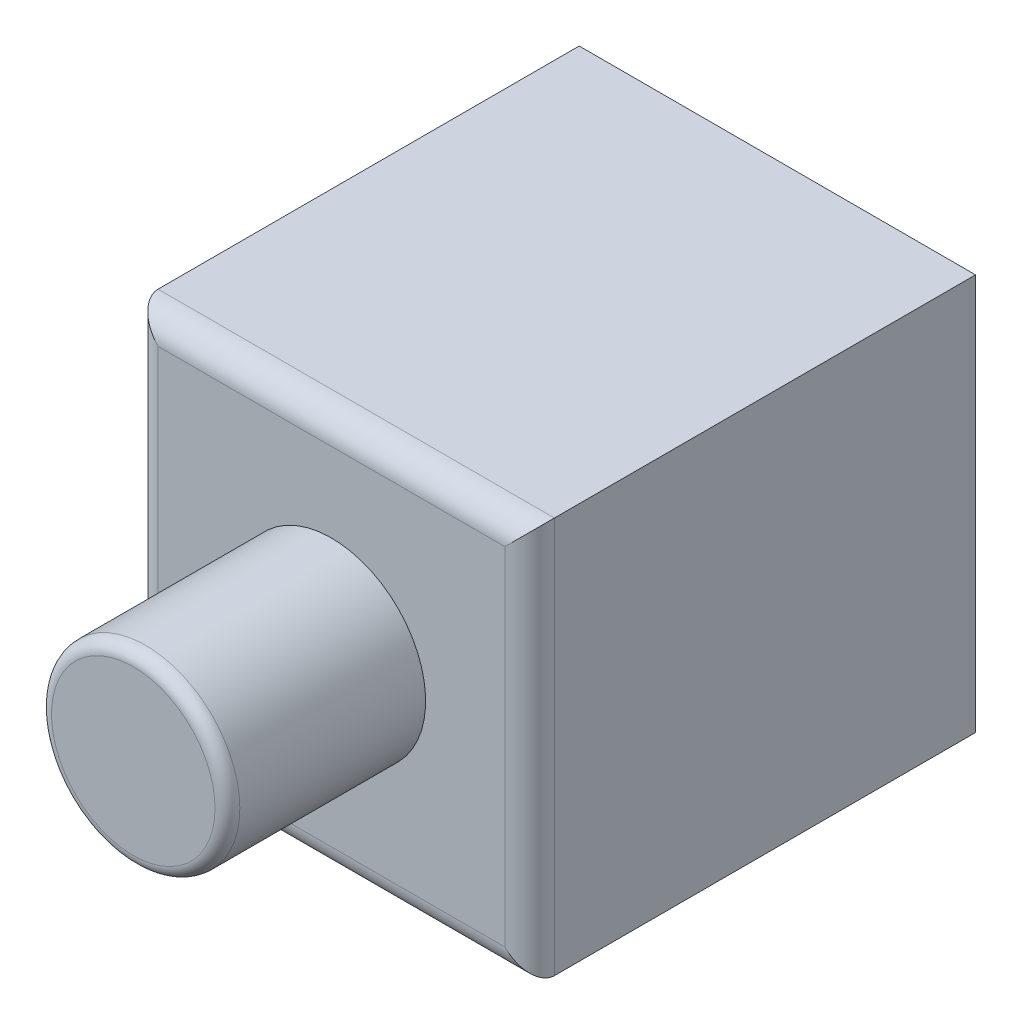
ISO-10303-21;
HEADER;
FILE_DESCRIPTION(('STEP AP214'),'2;1');
FILE_NAME('part.step','',(''),(''),'','','');
FILE_SCHEMA(('AUTOMOTIVE_DESIGN { 1 0 10303 214 1 1 1 1 }'));
ENDSEC;
DATA;
#1=APPLICATION_CONTEXT('core data for automotive mechanical design processes');
#2=APPLICATION_PROTOCOL_DEFINITION('international standard','automotive_design',2000,#1);
#3=PRODUCT_CONTEXT('',#1,'mechanical');
#4=PRODUCT('Part','Part','',(#3));
#5=PRODUCT_RELATED_PRODUCT_CATEGORY('part','',(#4));
#6=PRODUCT_DEFINITION_FORMATION('','',#4);
#7=PRODUCT_DEFINITION_CONTEXT('part definition',#1,'design');
#8=PRODUCT_DEFINITION('design','',#6,#7);
#9=PRODUCT_DEFINITION_SHAPE('','',#8);
#10=(LENGTH_UNIT() NAMED_UNIT(*) SI_UNIT(.MILLI.,.METRE.));
#11=(NAMED_UNIT(*) PLANE_ANGLE_UNIT() SI_UNIT($,.RADIAN.));
#12=(NAMED_UNIT(*) SI_UNIT($,.STERADIAN.) SOLID_ANGLE_UNIT());
#13=UNCERTAINTY_MEASURE_WITH_UNIT(LENGTH_MEASURE(1.E-05),#10,'distance_accuracy_value','');
#14=(GEOMETRIC_REPRESENTATION_CONTEXT(3) GLOBAL_UNCERTAINTY_ASSIGNED_CONTEXT((#13)) GLOBAL_UNIT_ASSIGNED_CONTEXT((#10,
#11,#12)) REPRESENTATION_CONTEXT('',''));
#15=CARTESIAN_POINT('',(0.,0.,0.));
#16=DIRECTION('',(0.,0.,1.));
#17=DIRECTION('',(1.,0.,0.));
#18=AXIS2_PLACEMENT_3D('',#15,#16,#17);
#19=CARTESIAN_POINT('',(-4.00000000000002,4.,9.00000000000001));
#20=DIRECTION('',(0.,0.,1.));
#21=DIRECTION('',(1.,0.,0.));
#22=AXIS2_PLACEMENT_3D('',#19,#20,#21);
#23=PLANE('',#22);
#24=DIRECTION('',(-1.,0.,0.));
#25=VECTOR('',#24,1.);
#26=CARTESIAN_POINT('',(-4.00000000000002,3.5,9.00000000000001));
#27=LINE('',#26,#25);
#28=CARTESIAN_POINT('',(3.5,3.5,9.00000000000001));
#29=VERTEX_POINT('',#28);
#30=CARTESIAN_POINT('',(-3.50000000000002,3.5,9.00000000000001));
#31=VERTEX_POINT('',#30);
#32=EDGE_CURVE('E120',#29,#31,#27,.T.);
#33=ORIENTED_EDGE('',*,*,#32,.T.);
#34=DIRECTION('',(0.,-1.,0.));
#35=VECTOR('',#34,1.);
#36=CARTESIAN_POINT('',(-3.50000000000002,-4.00000000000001,9.00000000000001));
#37=LINE('',#36,#35);
#38=CARTESIAN_POINT('',(-3.50000000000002,-3.50000000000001,9.00000000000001));
#39=VERTEX_POINT('',#38);
#40=EDGE_CURVE('E126',#31,#39,#37,.T.);
#41=ORIENTED_EDGE('',*,*,#40,.T.);
#42=DIRECTION('',(1.,0.,0.));
#43=VECTOR('',#42,1.);
#44=CARTESIAN_POINT('',(4.,-3.5,9.00000000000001));
#45=LINE('',#44,#43);
#46=CARTESIAN_POINT('',(3.5,-3.5,9.00000000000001));
#47=VERTEX_POINT('',#46);
#48=EDGE_CURVE('E124',#39,#47,#45,.T.);
#49=ORIENTED_EDGE('',*,*,#48,.T.);
#50=DIRECTION('',(0.,1.,0.));
#51=VECTOR('',#50,1.);
#52=CARTESIAN_POINT('',(3.5,4.,9.00000000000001));
#53=LINE('',#52,#51);
#54=EDGE_CURVE('E122',#47,#29,#53,.T.);
#55=ORIENTED_EDGE('',*,*,#54,.T.);
#56=EDGE_LOOP('',(#33,#41,#49,#55));
#57=FACE_BOUND('',#56,.T.);
#58=CARTESIAN_POINT('',(0.,0.,9.00000000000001));
#59=DIRECTION('',(0.,0.,1.));
#60=DIRECTION('',(1.,0.,0.));
#61=AXIS2_PLACEMENT_3D('',#58,#59,#60);
#62=CIRCLE('',#61,1.9);
#63=CARTESIAN_POINT('',(-1.9,0.,9.00000000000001));
#64=VERTEX_POINT('',#63);
#65=EDGE_CURVE('E101',#64,#64,#62,.F.);
#66=ORIENTED_EDGE('',*,*,#65,.T.);
#67=EDGE_LOOP('',(#66));
#68=FACE_BOUND('',#67,.T.);
#69=ADVANCED_FACE('F26',(#57,#68),#23,.T.);
#70=CARTESIAN_POINT('',(-4.00000000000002,4.,9.00000000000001));
#71=DIRECTION('',(1.,0.,0.));
#72=DIRECTION('',(0.,0.,-1.));
#73=AXIS2_PLACEMENT_3D('',#70,#71,#72);
#74=PLANE('',#73);
#75=DIRECTION('',(0.,0.,-1.));
#76=VECTOR('',#75,1.);
#77=CARTESIAN_POINT('',(-4.00000000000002,-4.00000000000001,9.00000000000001));
#78=LINE('',#77,#76);
#79=CARTESIAN_POINT('',(-4.00000000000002,-4.00000000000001,8.5));
#80=VERTEX_POINT('',#79);
#81=CARTESIAN_POINT('',(-4.00000000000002,-4.00000000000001,0.));
#82=VERTEX_POINT('',#81);
#83=EDGE_CURVE('E77',#80,#82,#78,.T.);
#84=ORIENTED_EDGE('',*,*,#83,.F.);
#85=DIRECTION('',(0.,-1.,0.));
#86=VECTOR('',#85,1.);
#87=CARTESIAN_POINT('',(-4.00000000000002,4.,8.5));
#88=LINE('',#87,#86);
#89=CARTESIAN_POINT('',(-4.00000000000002,4.,8.5));
#90=VERTEX_POINT('',#89);
#91=EDGE_CURVE('E129',#80,#90,#88,.F.);
#92=ORIENTED_EDGE('',*,*,#91,.T.);
#93=DIRECTION('',(0.,0.,-1.));
#94=VECTOR('',#93,1.);
#95=CARTESIAN_POINT('',(-4.00000000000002,4.,9.00000000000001));
#96=LINE('',#95,#94);
#97=CARTESIAN_POINT('',(-4.00000000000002,4.,0.));
#98=VERTEX_POINT('',#97);
#99=EDGE_CURVE('E99',#90,#98,#96,.T.);
#100=ORIENTED_EDGE('',*,*,#99,.T.);
#101=DIRECTION('',(0.,-1.,0.));
#102=VECTOR('',#101,1.);
#103=CARTESIAN_POINT('',(-4.00000000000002,4.,0.));
#104=LINE('',#103,#102);
#105=EDGE_CURVE('E95',#98,#82,#104,.T.);
#106=ORIENTED_EDGE('',*,*,#105,.T.);
#107=EDGE_LOOP('',(#84,#92,#100,#106));
#108=FACE_BOUND('',#107,.T.);
#109=ADVANCED_FACE('F28',(#108),#74,.F.);
#110=CARTESIAN_POINT('',(-4.00000000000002,-4.00000000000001,9.00000000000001));
#111=DIRECTION('',(0.,1.,0.));
#112=DIRECTION('',(-1.,0.,0.));
#113=AXIS2_PLACEMENT_3D('',#110,#111,#112);
#114=PLANE('',#113);
#115=DIRECTION('',(0.,0.,-1.));
#116=VECTOR('',#115,1.);
#117=CARTESIAN_POINT('',(4.,-4.,9.00000000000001));
#118=LINE('',#117,#116);
#119=CARTESIAN_POINT('',(4.,-4.,8.5));
#120=VERTEX_POINT('',#119);
#121=CARTESIAN_POINT('',(4.,-4.,0.));
#122=VERTEX_POINT('',#121);
#123=EDGE_CURVE('E89',#120,#122,#118,.T.);
#124=ORIENTED_EDGE('',*,*,#123,.F.);
#125=DIRECTION('',(1.,0.,0.));
#126=VECTOR('',#125,1.);
#127=CARTESIAN_POINT('',(-4.00000000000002,-4.00000000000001,8.5));
#128=LINE('',#127,#126);
#129=EDGE_CURVE('E83',#120,#80,#128,.F.);
#130=ORIENTED_EDGE('',*,*,#129,.T.);
#131=ORIENTED_EDGE('',*,*,#83,.T.);
#132=DIRECTION('',(1.,0.,0.));
#133=VECTOR('',#132,1.);
#134=CARTESIAN_POINT('',(-4.00000000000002,-4.00000000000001,0.));
#135=LINE('',#134,#133);
#136=EDGE_CURVE('E80',#82,#122,#135,.T.);
#137=ORIENTED_EDGE('',*,*,#136,.T.);
#138=EDGE_LOOP('',(#124,#130,#131,#137));
#139=FACE_BOUND('',#138,.T.);
#140=ADVANCED_FACE('F79',(#139),#114,.F.);
#141=CARTESIAN_POINT('',(4.,4.,9.00000000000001));
#142=DIRECTION('',(-1.,0.,0.));
#143=DIRECTION('',(0.,0.,1.));
#144=AXIS2_PLACEMENT_3D('',#141,#142,#143);
#145=PLANE('',#144);
#146=DIRECTION('',(0.,0.,-1.));
#147=VECTOR('',#146,1.);
#148=CARTESIAN_POINT('',(4.,4.,9.00000000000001));
#149=LINE('',#148,#147);
#150=CARTESIAN_POINT('',(4.,4.,8.5));
#151=VERTEX_POINT('',#150);
#152=CARTESIAN_POINT('',(4.,4.,0.));
#153=VERTEX_POINT('',#152);
#154=EDGE_CURVE('E112',#151,#153,#149,.T.);
#155=ORIENTED_EDGE('',*,*,#154,.F.);
#156=DIRECTION('',(0.,1.,0.));
#157=VECTOR('',#156,1.);
#158=CARTESIAN_POINT('',(4.,-4.,8.5));
#159=LINE('',#158,#157);
#160=EDGE_CURVE('E34',#151,#120,#159,.F.);
#161=ORIENTED_EDGE('',*,*,#160,.T.);
#162=ORIENTED_EDGE('',*,*,#123,.T.);
#163=DIRECTION('',(0.,1.,0.));
#164=VECTOR('',#163,1.);
#165=CARTESIAN_POINT('',(4.,4.,0.));
#166=LINE('',#165,#164);
#167=EDGE_CURVE('E97',#122,#153,#166,.T.);
#168=ORIENTED_EDGE('',*,*,#167,.T.);
#169=EDGE_LOOP('',(#155,#161,#162,#168));
#170=FACE_BOUND('',#169,.T.);
#171=ADVANCED_FACE('F134',(#170),#145,.F.);
#172=CARTESIAN_POINT('',(-4.00000000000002,4.,9.00000000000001));
#173=DIRECTION('',(0.,-1.,0.));
#174=DIRECTION('',(1.,0.,0.));
#175=AXIS2_PLACEMENT_3D('',#172,#173,#174);
#176=PLANE('',#175);
#177=ORIENTED_EDGE('',*,*,#99,.F.);
#178=DIRECTION('',(-1.,0.,0.));
#179=VECTOR('',#178,1.);
#180=CARTESIAN_POINT('',(4.,4.,8.5));
#181=LINE('',#180,#179);
#182=EDGE_CURVE('E11',#90,#151,#181,.F.);
#183=ORIENTED_EDGE('',*,*,#182,.T.);
#184=ORIENTED_EDGE('',*,*,#154,.T.);
#185=DIRECTION('',(-1.,0.,0.));
#186=VECTOR('',#185,1.);
#187=CARTESIAN_POINT('',(-4.00000000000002,4.,0.));
#188=LINE('',#187,#186);
#189=EDGE_CURVE('E109',#153,#98,#188,.T.);
#190=ORIENTED_EDGE('',*,*,#189,.T.);
#191=EDGE_LOOP('',(#177,#183,#184,#190));
#192=FACE_BOUND('',#191,.T.);
#193=ADVANCED_FACE('F133',(#192),#176,.F.);
#194=CARTESIAN_POINT('',(-4.00000000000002,4.,0.));
#195=DIRECTION('',(0.,0.,1.));
#196=DIRECTION('',(1.,0.,0.));
#197=AXIS2_PLACEMENT_3D('',#194,#195,#196);
#198=PLANE('',#197);
#199=ORIENTED_EDGE('',*,*,#105,.F.);
#200=ORIENTED_EDGE('',*,*,#189,.F.);
#201=ORIENTED_EDGE('',*,*,#167,.F.);
#202=ORIENTED_EDGE('',*,*,#136,.F.);
#203=EDGE_LOOP('',(#199,#200,#201,#202));
#204=FACE_BOUND('',#203,.T.);
#205=ADVANCED_FACE('F93',(#204),#198,.F.);
#206=CARTESIAN_POINT('',(0.,0.,13.));
#207=DIRECTION('',(0.,0.,-1.));
#208=DIRECTION('',(-1.,0.,0.));
#209=AXIS2_PLACEMENT_3D('',#206,#207,#208);
#210=CYLINDRICAL_SURFACE('',#209,1.9);
#211=CARTESIAN_POINT('',(0.,0.,12.75));
#212=DIRECTION('',(0.,0.,1.));
#213=DIRECTION('',(1.,0.,0.));
#214=AXIS2_PLACEMENT_3D('',#211,#212,#213);
#215=CIRCLE('',#214,1.9);
#216=CARTESIAN_POINT('',(-1.9,0.,12.75));
#217=VERTEX_POINT('',#216);
#218=EDGE_CURVE('E117',#217,#217,#215,.F.);
#219=CARTESIAN_POINT('',(-1.9,0.,12.75));
#220=CARTESIAN_POINT('',(-1.9,0.,12.7109375));
#221=CARTESIAN_POINT('',(-1.9,0.,12.671875));
#222=CARTESIAN_POINT('',(-1.9,0.,12.59375));
#223=CARTESIAN_POINT('',(-1.9,0.,12.5546875));
#224=CARTESIAN_POINT('',(-1.9,0.,12.4765625));
#225=CARTESIAN_POINT('',(-1.9,0.,12.4375));
#226=CARTESIAN_POINT('',(-1.9,0.,12.359375));
#227=CARTESIAN_POINT('',(-1.9,0.,12.3203125));
#228=CARTESIAN_POINT('',(-1.9,0.,12.2421875));
#229=CARTESIAN_POINT('',(-1.9,0.,12.203125));
#230=CARTESIAN_POINT('',(-1.9,0.,12.125));
#231=CARTESIAN_POINT('',(-1.9,0.,12.0859375));
#232=CARTESIAN_POINT('',(-1.9,0.,12.0078125));
#233=CARTESIAN_POINT('',(-1.9,0.,11.96875));
#234=CARTESIAN_POINT('',(-1.9,0.,11.890625));
#235=CARTESIAN_POINT('',(-1.9,0.,11.8515625));
#236=CARTESIAN_POINT('',(-1.9,0.,11.7734375));
#237=CARTESIAN_POINT('',(-1.9,0.,11.734375));
#238=CARTESIAN_POINT('',(-1.9,0.,11.65625));
#239=CARTESIAN_POINT('',(-1.9,0.,11.6171875));
#240=CARTESIAN_POINT('',(-1.9,0.,11.5390625));
#241=CARTESIAN_POINT('',(-1.9,0.,11.5));
#242=CARTESIAN_POINT('',(-1.9,0.,11.421875));
#243=CARTESIAN_POINT('',(-1.9,0.,11.3828125));
#244=CARTESIAN_POINT('',(-1.9,0.,11.3046875));
#245=CARTESIAN_POINT('',(-1.9,0.,11.265625));
#246=CARTESIAN_POINT('',(-1.9,0.,11.1875));
#247=CARTESIAN_POINT('',(-1.9,0.,11.1484375));
#248=CARTESIAN_POINT('',(-1.9,0.,11.0703125));
#249=CARTESIAN_POINT('',(-1.9,0.,11.03125));
#250=CARTESIAN_POINT('',(-1.9,0.,10.953125));
#251=CARTESIAN_POINT('',(-1.9,0.,10.9140625));
#252=CARTESIAN_POINT('',(-1.9,0.,10.8359375));
#253=CARTESIAN_POINT('',(-1.9,0.,10.796875));
#254=CARTESIAN_POINT('',(-1.9,0.,10.71875));
#255=CARTESIAN_POINT('',(-1.9,0.,10.6796875));
#256=CARTESIAN_POINT('',(-1.9,0.,10.6015625));
#257=CARTESIAN_POINT('',(-1.9,0.,10.5625));
#258=CARTESIAN_POINT('',(-1.9,0.,10.484375));
#259=CARTESIAN_POINT('',(-1.9,0.,10.4453125));
#260=CARTESIAN_POINT('',(-1.9,0.,10.3671875));
#261=CARTESIAN_POINT('',(-1.9,0.,10.328125));
#262=CARTESIAN_POINT('',(-1.9,0.,10.25));
#263=CARTESIAN_POINT('',(-1.9,0.,10.2109375));
#264=CARTESIAN_POINT('',(-1.9,0.,10.1328125));
#265=CARTESIAN_POINT('',(-1.9,0.,10.09375));
#266=CARTESIAN_POINT('',(-1.9,0.,10.015625));
#267=CARTESIAN_POINT('',(-1.9,0.,9.9765625));
#268=CARTESIAN_POINT('',(-1.9,0.,9.8984375));
#269=CARTESIAN_POINT('',(-1.9,0.,9.859375));
#270=CARTESIAN_POINT('',(-1.9,0.,9.78125));
#271=CARTESIAN_POINT('',(-1.9,0.,9.7421875));
#272=CARTESIAN_POINT('',(-1.9,0.,9.6640625));
#273=CARTESIAN_POINT('',(-1.9,0.,9.625));
#274=CARTESIAN_POINT('',(-1.9,0.,9.546875));
#275=CARTESIAN_POINT('',(-1.9,0.,9.5078125));
#276=CARTESIAN_POINT('',(-1.9,0.,9.4296875));
#277=CARTESIAN_POINT('',(-1.9,0.,9.390625));
#278=CARTESIAN_POINT('',(-1.9,0.,9.3125));
#279=CARTESIAN_POINT('',(-1.9,0.,9.2734375));
#280=CARTESIAN_POINT('',(-1.9,0.,9.1953125));
#281=CARTESIAN_POINT('',(-1.9,0.,9.15625));
#282=CARTESIAN_POINT('',(-1.9,0.,9.07812500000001));
#283=CARTESIAN_POINT('',(-1.9,0.,9.0390625));
#284=CARTESIAN_POINT('',(-1.9,0.,9.00000000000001));
#285=B_SPLINE_CURVE_WITH_KNOTS('',3,(#219,#220,#221,#222,#223,#224,#225,#226,#227,#228,#229,
#230,#231,#232,#233,#234,#235,#236,#237,#238,#239,#240,#241,#242,#243,#244,#245,#246,#247,#248,
#249,#250,#251,#252,#253,#254,#255,#256,#257,#258,#259,#260,#261,#262,#263,#264,#265,#266,#267,
#268,#269,#270,#271,#272,#273,#274,#275,#276,#277,#278,#279,#280,#281,#282,#283,#284),
.UNSPECIFIED.,.F.,.F.,(4,2,2,2,2,2,2,2,2,2,2,2,2,2,2,2,2,2,2,2,2,2,2,2,2,2,2,2,2,2,2,2,4),(0.,
0.117187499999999,0.234374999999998,0.351562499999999,0.468749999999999,0.585937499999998,
0.703124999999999,0.820312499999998,0.937499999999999,1.0546875,1.171875,1.2890625,1.40625,
1.5234375,1.640625,1.7578125,1.875,1.9921875,2.109375,2.2265625,2.34375,2.4609375,2.578125,
2.6953125,2.8125,2.9296875,3.046875,3.1640625,3.28125,3.3984375,3.515625,3.6328125,
3.74999999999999),.UNSPECIFIED.);
#286=EDGE_CURVE('BSEAM189',#217,#64,#285,.T.);
#287=ORIENTED_EDGE('',*,*,#218,.T.);
#288=ORIENTED_EDGE('',*,*,#65,.F.);
#289=ORIENTED_EDGE('',*,*,#286,.T.);
#290=ORIENTED_EDGE('',*,*,#286,.F.);
#291=EDGE_LOOP('',(#287,#289,#288,#290));
#292=FACE_BOUND('',#291,.T.);
#293=ADVANCED_FACE('F189',(#292),#210,.T.);
#294=CARTESIAN_POINT('',(0.,0.,13.));
#295=DIRECTION('',(0.,0.,1.));
#296=DIRECTION('',(1.,0.,0.));
#297=AXIS2_PLACEMENT_3D('',#294,#295,#296);
#298=PLANE('',#297);
#299=CARTESIAN_POINT('',(0.,0.,13.));
#300=DIRECTION('',(0.,0.,1.));
#301=DIRECTION('',(1.,0.,0.));
#302=AXIS2_PLACEMENT_3D('',#299,#300,#301);
#303=CIRCLE('',#302,1.65);
#304=CARTESIAN_POINT('',(1.65,0.,13.));
#305=VERTEX_POINT('',#304);
#306=EDGE_CURVE('E88',#305,#305,#303,.T.);
#307=ORIENTED_EDGE('',*,*,#306,.T.);
#308=EDGE_LOOP('',(#307));
#309=FACE_BOUND('',#308,.T.);
#310=ADVANCED_FACE('F190',(#309),#298,.T.);
#311=CARTESIAN_POINT('',(0.,0.,12.75));
#312=DIRECTION('',(0.,0.,1.));
#313=DIRECTION('',(1.,0.,0.));
#314=AXIS2_PLACEMENT_3D('',#311,#312,#313);
#315=TOROIDAL_SURFACE('',#314,1.65,0.25);
#316=ORIENTED_EDGE('',*,*,#218,.F.);
#317=EDGE_LOOP('',(#316));
#318=FACE_BOUND('',#317,.T.);
#319=ORIENTED_EDGE('',*,*,#306,.F.);
#320=EDGE_LOOP('',(#319));
#321=FACE_BOUND('',#320,.T.);
#322=ADVANCED_FACE('F195',(#318,#321),#315,.T.);
#323=CARTESIAN_POINT('',(3.5,4.,8.5));
#324=DIRECTION('',(0.,-1.,0.));
#325=DIRECTION('',(0.,0.,-1.));
#326=AXIS2_PLACEMENT_3D('',#323,#324,#325);
#327=CYLINDRICAL_SURFACE('',#326,0.5);
#328=CARTESIAN_POINT('',(3.5,-3.5,8.5));
#329=DIRECTION('',(-0.707106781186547,-0.707106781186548,0.));
#330=DIRECTION('',(0.707106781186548,-0.707106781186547,0.));
#331=AXIS2_PLACEMENT_3D('',#328,#329,#330);
#332=ELLIPSE('',#331,0.707106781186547,0.5);
#333=EDGE_CURVE('E139',#120,#47,#332,.T.);
#334=ORIENTED_EDGE('',*,*,#333,.F.);
#335=ORIENTED_EDGE('',*,*,#160,.F.);
#336=CARTESIAN_POINT('',(3.5,3.5,8.5));
#337=DIRECTION('',(0.707106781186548,-0.707106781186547,0.));
#338=DIRECTION('',(0.707106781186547,0.707106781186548,0.));
#339=AXIS2_PLACEMENT_3D('',#336,#337,#338);
#340=ELLIPSE('',#339,0.707106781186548,0.5);
#341=EDGE_CURVE('E104',#29,#151,#340,.F.);
#342=ORIENTED_EDGE('',*,*,#341,.F.);
#343=ORIENTED_EDGE('',*,*,#54,.F.);
#344=EDGE_LOOP('',(#334,#335,#342,#343));
#345=FACE_BOUND('',#344,.T.);
#346=ADVANCED_FACE('F140',(#345),#327,.T.);
#347=CARTESIAN_POINT('',(-4.00000000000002,3.5,8.5));
#348=DIRECTION('',(1.,0.,0.));
#349=DIRECTION('',(0.,1.,0.));
#350=AXIS2_PLACEMENT_3D('',#347,#348,#349);
#351=CYLINDRICAL_SURFACE('',#350,0.5);
#352=ORIENTED_EDGE('',*,*,#341,.T.);
#353=ORIENTED_EDGE('',*,*,#182,.F.);
#354=CARTESIAN_POINT('',(-3.50000000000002,3.5,8.5));
#355=DIRECTION('',(0.707106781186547,0.707106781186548,0.));
#356=DIRECTION('',(0.707106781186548,-0.707106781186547,0.));
#357=AXIS2_PLACEMENT_3D('',#354,#355,#356);
#358=ELLIPSE('',#357,0.707106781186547,0.5);
#359=EDGE_CURVE('E145',#31,#90,#358,.F.);
#360=ORIENTED_EDGE('',*,*,#359,.F.);
#361=ORIENTED_EDGE('',*,*,#32,.F.);
#362=EDGE_LOOP('',(#352,#353,#360,#361));
#363=FACE_BOUND('',#362,.T.);
#364=ADVANCED_FACE('F154',(#363),#351,.T.);
#365=CARTESIAN_POINT('',(-3.99999999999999,-3.50000000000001,8.5));
#366=DIRECTION('',(-1.,0.,0.));
#367=DIRECTION('',(0.,-1.,0.));
#368=AXIS2_PLACEMENT_3D('',#365,#366,#367);
#369=CYLINDRICAL_SURFACE('',#368,0.5);
#370=ORIENTED_EDGE('',*,*,#333,.T.);
#371=ORIENTED_EDGE('',*,*,#48,.F.);
#372=CARTESIAN_POINT('',(-3.50000000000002,-3.50000000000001,8.5));
#373=DIRECTION('',(-0.707106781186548,0.707106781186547,0.));
#374=DIRECTION('',(-0.707106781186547,-0.707106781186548,0.));
#375=AXIS2_PLACEMENT_3D('',#372,#373,#374);
#376=ELLIPSE('',#375,0.707106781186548,0.5);
#377=EDGE_CURVE('E148',#80,#39,#376,.T.);
#378=ORIENTED_EDGE('',*,*,#377,.F.);
#379=ORIENTED_EDGE('',*,*,#129,.F.);
#380=EDGE_LOOP('',(#370,#371,#378,#379));
#381=FACE_BOUND('',#380,.T.);
#382=ADVANCED_FACE('F147',(#381),#369,.T.);
#383=CARTESIAN_POINT('',(-3.50000000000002,4.,8.5));
#384=DIRECTION('',(0.,1.,0.));
#385=DIRECTION('',(0.,0.,1.));
#386=AXIS2_PLACEMENT_3D('',#383,#384,#385);
#387=CYLINDRICAL_SURFACE('',#386,0.5);
#388=ORIENTED_EDGE('',*,*,#359,.T.);
#389=ORIENTED_EDGE('',*,*,#91,.F.);
#390=ORIENTED_EDGE('',*,*,#377,.T.);
#391=ORIENTED_EDGE('',*,*,#40,.F.);
#392=EDGE_LOOP('',(#388,#389,#390,#391));
#393=FACE_BOUND('',#392,.T.);
#394=ADVANCED_FACE('F158',(#393),#387,.T.);
#395=CLOSED_SHELL('',(#69,#109,#140,#171,#193,#205,#293,#310,#322,#346,#364,#382,#394));
#396=MANIFOLD_SOLID_BREP('B2',#395);
#397=ADVANCED_BREP_SHAPE_REPRESENTATION('',(#18,#396),#14);
#398=SHAPE_DEFINITION_REPRESENTATION(#9,#397);
ENDSEC;
END-ISO-10303-21;
